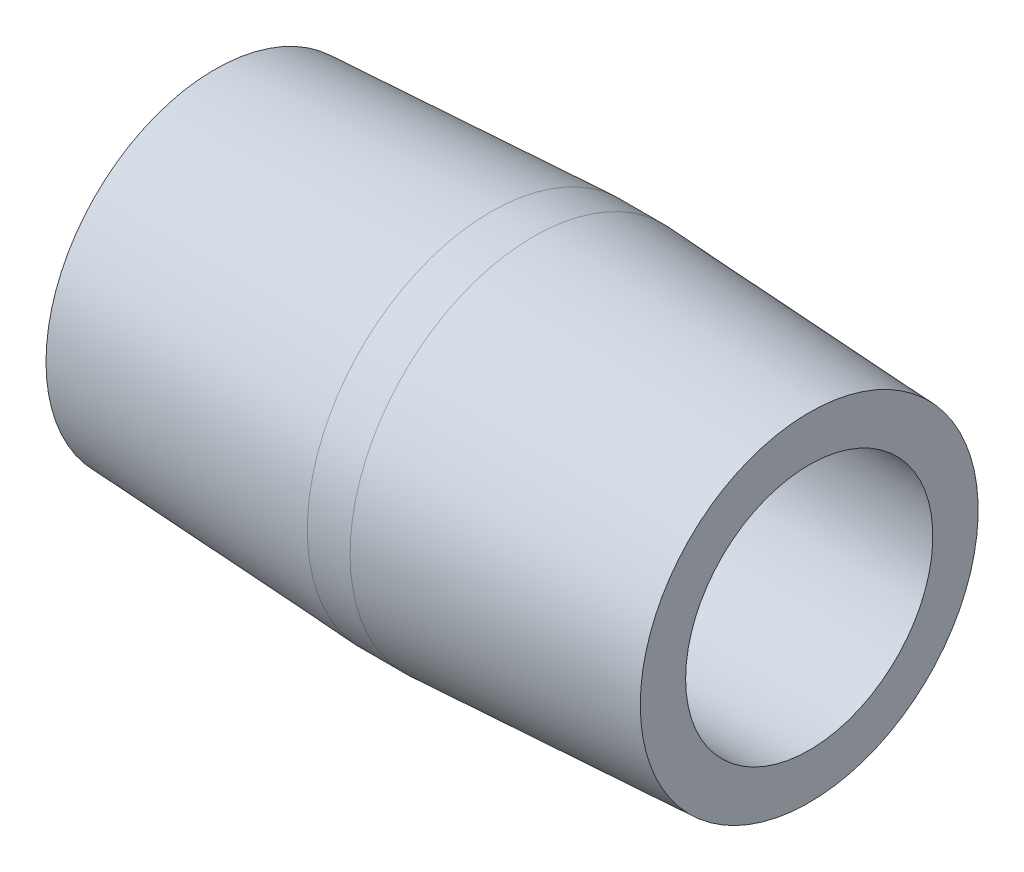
from build123d import *


with BuildPart() as part:
    # Sketch1 → Revolve1 (revolve)
    with BuildSketch(Plane(origin=(0, 0, 0), x_dir=(1, 0, 0), z_dir=(0, 1, 0)), mode=Mode.PRIVATE) as revolve1_sk:
        Polygon((22.225, 4.622776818), (0, 4.622776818), (0, 6.317526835), (10.3124, 6.857976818), (11.9126, 6.857976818), (22.225, 6.317526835), align=None)
    revolve(revolve1_sk.sketch.rotate(Axis((-6.375994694, 0, 0), (1, 0, 0)), 180), axis=Axis((-6.375994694, 0, 0), (1, 0, 0)))


solid = part.part
